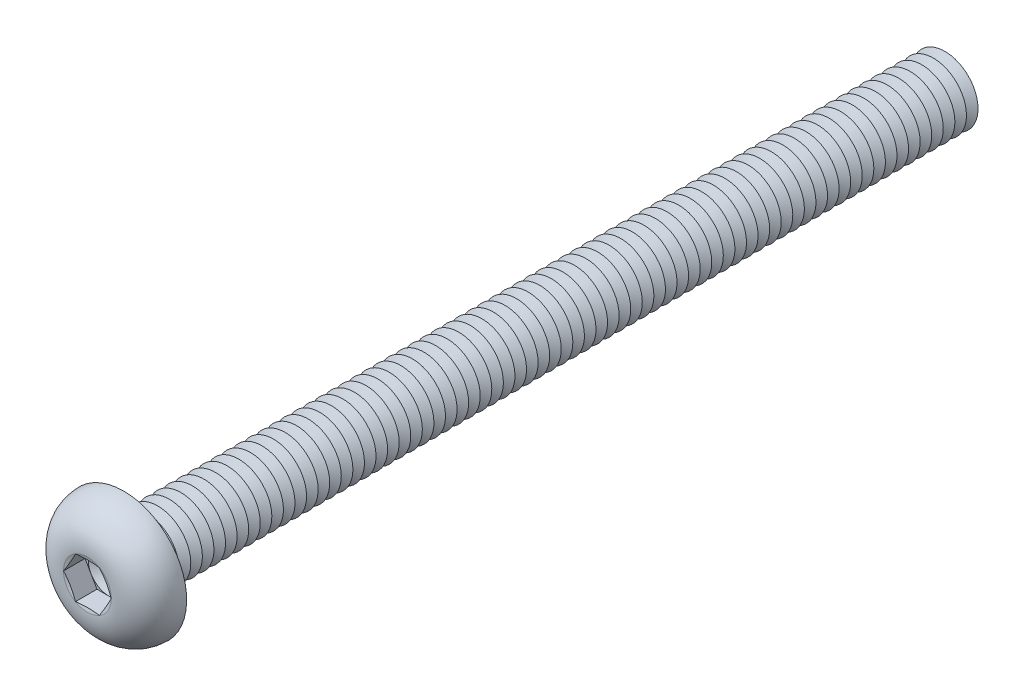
from build123d import *

# Parameters (mm, degrees)
FILLET1_R          = 0.35
LPATTERN1_COUNT    = 71
LPATTERN1_PITCH    = 0.7
CUT_EXTRUDE1_DEPTH = 1.3


with BuildPart() as part:
    # Sketch1 → Revolve1 (revolve)
    with BuildSketch(Plane(origin=(0, 0, 0), x_dir=(0, 0, -1), z_dir=(1, 0, 0))):
        with BuildLine():
            Line((0, 2), (0, 3.8))
            ThreePointArc((0, 3.8), (-1.611961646, 3.099623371), (-2.2, 1.443375))
            Line((-2.2, 1.443375), (-2.006624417, 0.7216875))
            Line((-2.006624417, 0.7216875), (-2.2, 0.7216875))
            Line((-2.2, 0.7216875), (-2.2, 0))
            Line((-2.2, 0), (50, 0))
            Line((50, 0), (50, 2))
            Line((50, 2), (0, 2))
        make_face()
    revolve(axis=Axis((0, 0, -50), (0, 0, 1)))

    # Fillet1
    fillet1_edges = [part.edges().sort_by_distance(p)[0] for p in [
        (0, -2, 0),
    ]]
    fillet(fillet1_edges, radius=FILLET1_R)

    # Sketch2 → Cut-Revolve1 (revolve, cut)
    with BuildSketch(Plane(origin=(0, 0, 0), x_dir=(0, 0, -1), z_dir=(1, 0, 0))):
        Polygon((49.65, 2), (50.35, 2), (50, 1.393782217), align=None)
    cut_revolve1 = revolve(axis=Axis((0, 0, -50), (0, 0, -1)), mode=Mode.SUBTRACT)

    # LPattern1: Cut-Revolve1 ×71
    with Locations(*[(0, 0, i * LPATTERN1_PITCH) for i in range(1, LPATTERN1_COUNT)]):
        add(cut_revolve1, mode=Mode.SUBTRACT)

    # Sketch3 → Cut-Extrude1 (cut)
    with BuildSketch(Plane.XY.offset(2.2)):
        Polygon((0.7216875, 1.249999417), (-0.7216875, 1.249999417), (-1.443375, 0), (-0.7216875, -1.249999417), (0.7216875, -1.249999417), (1.443375, 0), align=None)
    extrude(amount=-CUT_EXTRUDE1_DEPTH, mode=Mode.SUBTRACT)

    # Cut-Extrude2 cone 1 section (on through the dimple's axis) → Cut-Extrude2 (revolve, cut)
    with BuildSketch(Plane(origin=(0, 0, 0.9), x_dir=(0, -1, 0), z_dir=(1, 0, 0))):
        Polygon((0, 0), (1.249999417, 0), (0, 0.7216875), align=None)
    revolve(axis=Axis((0, 0, 0.9), (0, 0, -1)), mode=Mode.SUBTRACT)


solid = part.part
